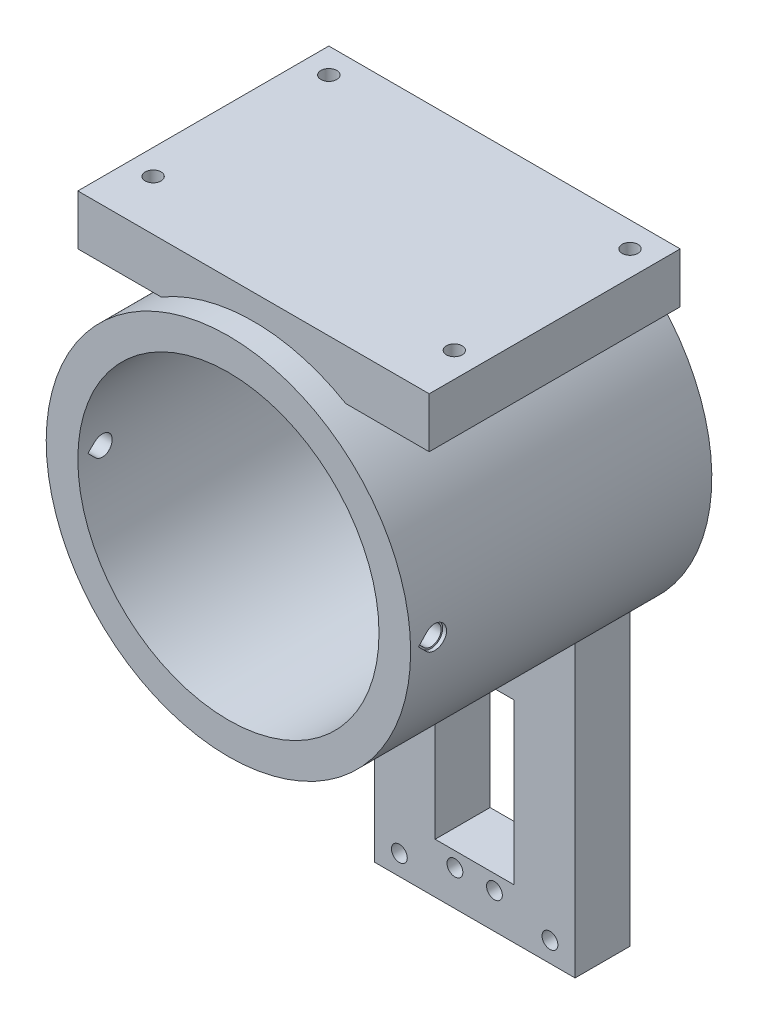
from build123d import *
from build123d.topology import SkipClean

# Parameters (mm, degrees)
SKETCH1_R                = 38.1
SKETCH1_W                = 20
SKETCH1_H                = 40.5
BOSS_EXTRUDE1_DEPTH      = 76.2
CUT_EXTRUDE1_DEPTH       = 144.916477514
CUT_EXTRUDE1_DEPTH_BACK  = 144.916477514
CUT_EXTRUDE2_START       = -1
CUT_EXTRUDE2_DEPTH       = 1
CUT_EXTRUDE3_DEPTH       = 144.9164776
CUT_EXTRUDE3_DEPTH_BACK  = 62.3
CUT_EXTRUDE22_DEPTH      = 138.064957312
CUT_EXTRUDE22_DEPTH_BACK = 11.36
SKETCH50_R               = 2
BOSS_EXTRUDE2_DEPTH      = 6.35
BOSS_EXTRUDE2_DEPTH_BACK = 6.35
SKETCH51_W               = 88.9
SKETCH51_H               = 63.5
SKETCH52_R               = 2
CUT_EXTRUDE23_DEPTH      = 138.064957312
SKETCH53_R               = 2
CUT_EXTRUDE24_DEPTH      = 12.7


with BuildPart() as part:
    # Sketch1 → Boss-Extrude1 (new body)
    with BuildSketch(Plane.XY):
        with BuildLine():
            Line((-25.4, -38.471417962), (-25.4, -113.05))
            Line((-25.4, -113.05), (25.4, -113.05))
            Line((25.4, -113.05), (25.4, -38.471417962))
            ThreePointArc((25.4, -38.471417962), (0, 46.1), (-25.4, -38.471417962))
        make_face()
        with Locations(Location((0, 0, 0), (0, 0, 180))):
            Circle(SKETCH1_R, mode=Mode.SUBTRACT)
        with Locations((0, -80.1)):
            Rectangle(SKETCH1_W, SKETCH1_H, mode=Mode.SUBTRACT)
    extrude(amount=BOSS_EXTRUDE1_DEPTH)

    # Sketch2 → Cut-Extrude1 (cut, two sides: drawn at the far end of the back side and taken through both)
    with BuildSketch(Plane(origin=(0, 0, 0), x_dir=(0, 0, -1), z_dir=(1, 0, 0)).offset(-CUT_EXTRUDE1_DEPTH_BACK)):
        with BuildLine():
            Line((-71.856877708, -1.803122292), (-73.66, 0))
            Line((-73.66, 0), (-71.856877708, 1.803122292))
            ThreePointArc((-71.856877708, 1.803122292), (-67.503755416, 0), (-71.856877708, -1.803122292))
        make_face()
    extrude(amount=CUT_EXTRUDE1_DEPTH + CUT_EXTRUDE1_DEPTH_BACK, mode=Mode.SUBTRACT)

    # Sketch3 → Cut-Extrude2 (cut)
    with BuildSketch(Plane(origin=(46.1, 0, 0), x_dir=(0, 0, -1), z_dir=(1, 0, 0)).offset(CUT_EXTRUDE2_START)):
        with BuildLine():
            Line((-74.225685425, 0), (-72.13972042, 2.085965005))
            ThreePointArc((-72.13972042, 2.085965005), (-67.103755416, 0), (-72.13972042, -2.085965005))
            Line((-72.13972042, -2.085965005), (-74.225685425, 0))
        make_face()
        with BuildLine():
            Line((-71.856877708, -1.803122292), (-73.66, 0))
            Line((-73.66, 0), (-71.856877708, 1.803122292))
            ThreePointArc((-71.856877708, 1.803122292), (-67.503755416, 0), (-71.856877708, -1.803122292))
        make_face(mode=Mode.SUBTRACT)
    cut_extrude2 = extrude(amount=CUT_EXTRUDE2_DEPTH, mode=Mode.SUBTRACT)

    # Mirror1: Cut-Extrude2 across plane
    add(cut_extrude2.mirror(Plane(origin=(0, 0, 0), x_dir=(0, 0, 1), z_dir=(1, 0, 0))), mode=Mode.SUBTRACT)

    # Sketch4 → Cut-Extrude3 (cut, two sides: drawn at the far end of the back side and taken through both)
    with SkipClean():  # the faces are left unmerged after this step: merging them gives an invalid solid
        with BuildSketch(Plane.XY.offset(76.2).offset(-CUT_EXTRUDE3_DEPTH_BACK)):
            with BuildLine():
                Line((-25.4, -38.471417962), (-25.4, -113.05))
                Line((-25.4, -113.05), (25.4, -113.05))
                Line((25.4, -113.05), (25.4, -38.471417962))
                ThreePointArc((25.4, -38.471417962), (0, -46.1), (-25.4, -38.471417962))
            make_face()
        extrude(amount=CUT_EXTRUDE3_DEPTH + CUT_EXTRUDE3_DEPTH_BACK, mode=Mode.SUBTRACT)

    # Sketch50 → Cut-Extrude22 (cut, two sides: drawn at the far end of the back side and taken through both)
    with SkipClean():  # the faces are left unmerged after this step: merging them gives an invalid solid
        with BuildSketch(Plane.XY.offset(13.899999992).offset(-CUT_EXTRUDE22_DEPTH_BACK)):
            with Locations((5, -56.1)):
                Circle(SKETCH50_R)
            with Locations((-5, -56.1)):
                Circle(SKETCH50_R)
            with Locations((5, -104.1)):
                Circle(SKETCH50_R)
            with Locations((-5, -104.1)):
                Circle(SKETCH50_R)
        extrude(amount=CUT_EXTRUDE22_DEPTH + CUT_EXTRUDE22_DEPTH_BACK, mode=Mode.SUBTRACT)

    # Sketch51 → Boss-Extrude2 (add, two sides: drawn at the far end of the back side and taken through both)
    with SkipClean():  # the faces are left unmerged after this step: merging them gives an invalid solid
        with BuildSketch(Plane(origin=(0, 46.1, 0), x_dir=(1, 0, 0), z_dir=(0, 1, 0)).offset(-BOSS_EXTRUDE2_DEPTH_BACK)):
            with Locations((0, -38.1)):
                Rectangle(SKETCH51_W, SKETCH51_H)
        extrude(amount=BOSS_EXTRUDE2_DEPTH + BOSS_EXTRUDE2_DEPTH_BACK)

    # Sketch52 → Cut-Extrude23 (cut, through all)
    with SkipClean():  # the faces are left unmerged after this step: merging them gives an invalid solid
        with BuildSketch(Plane.XY.offset(13.899999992)):
            with Locations((19.05, -107.97)):
                Circle(SKETCH52_R)
            with Locations((-19.05, -107.97)):
                Circle(SKETCH52_R)
        extrude(amount=-CUT_EXTRUDE23_DEPTH, mode=Mode.SUBTRACT)

    # Sketch53 → Cut-Extrude24 (cut)
    with SkipClean():  # the faces are left unmerged after this step: merging them gives an invalid solid
        with BuildSketch(Plane(origin=(0, 52.45, 0), x_dir=(1, 0, 0), z_dir=(0, 1, 0))):
            with Locations(Location((-38.1, -12.7, 0), (0, 0, 270))):
                Circle(SKETCH53_R)
            with Locations(Location((-38.1, -57.15, 0), (0, 0, 270))):
                Circle(SKETCH53_R)
            with Locations(Location((38.1, -57.15, 0), (0, 0, 270))):
                Circle(SKETCH53_R)
            with Locations(Location((38.1, -12.7, 0), (0, 0, 270))):
                Circle(SKETCH53_R)
        extrude(amount=-CUT_EXTRUDE24_DEPTH, mode=Mode.SUBTRACT)


solid = part.part
